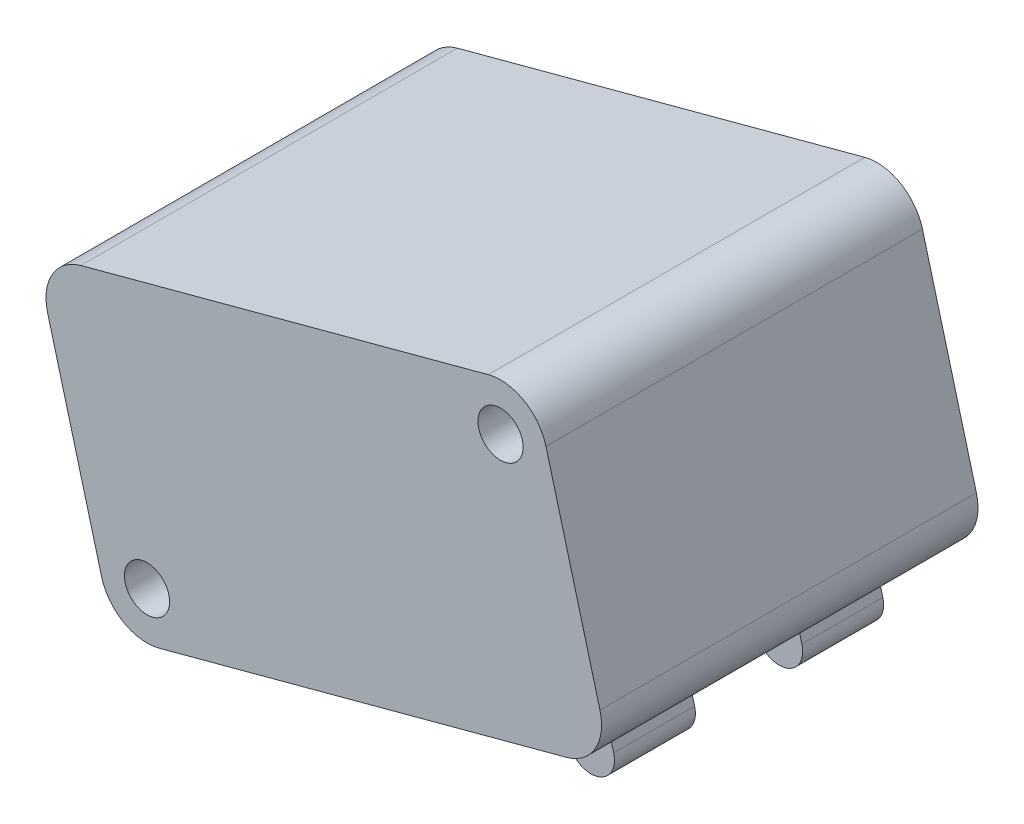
ISO-10303-21;
HEADER;
FILE_DESCRIPTION(('STEP AP214'),'2;1');
FILE_NAME('part.step','',(''),(''),'','','');
FILE_SCHEMA(('AUTOMOTIVE_DESIGN { 1 0 10303 214 1 1 1 1 }'));
ENDSEC;
DATA;
#1=APPLICATION_CONTEXT('core data for automotive mechanical design processes');
#2=APPLICATION_PROTOCOL_DEFINITION('international standard','automotive_design',2000,#1);
#3=PRODUCT_CONTEXT('',#1,'mechanical');
#4=PRODUCT('Part','Part','',(#3));
#5=PRODUCT_RELATED_PRODUCT_CATEGORY('part','',(#4));
#6=PRODUCT_DEFINITION_FORMATION('','',#4);
#7=PRODUCT_DEFINITION_CONTEXT('part definition',#1,'design');
#8=PRODUCT_DEFINITION('design','',#6,#7);
#9=PRODUCT_DEFINITION_SHAPE('','',#8);
#10=(LENGTH_UNIT() NAMED_UNIT(*) SI_UNIT(.MILLI.,.METRE.));
#11=(NAMED_UNIT(*) PLANE_ANGLE_UNIT() SI_UNIT($,.RADIAN.));
#12=(NAMED_UNIT(*) SI_UNIT($,.STERADIAN.) SOLID_ANGLE_UNIT());
#13=UNCERTAINTY_MEASURE_WITH_UNIT(LENGTH_MEASURE(1.E-05),#10,'distance_accuracy_value','');
#14=(GEOMETRIC_REPRESENTATION_CONTEXT(3) GLOBAL_UNCERTAINTY_ASSIGNED_CONTEXT((#13)) GLOBAL_UNIT_ASSIGNED_CONTEXT((#10,
#11,#12)) REPRESENTATION_CONTEXT('',''));
#15=CARTESIAN_POINT('',(0.,0.,0.));
#16=DIRECTION('',(0.,0.,1.));
#17=DIRECTION('',(1.,0.,0.));
#18=AXIS2_PLACEMENT_3D('',#15,#16,#17);
#19=CARTESIAN_POINT('',(-5.35712702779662,35.8393600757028,20.));
#20=DIRECTION('',(-0.258819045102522,0.965925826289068,0.));
#21=DIRECTION('',(-0.965925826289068,-0.258819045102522,0.));
#22=AXIS2_PLACEMENT_3D('',#19,#20,#21);
#23=PLANE('',#22);
#24=DIRECTION('',(0.,0.,-1.));
#25=VECTOR('',#24,1.);
#26=CARTESIAN_POINT('',(13.2004189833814,40.8118395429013,17.15));
#27=LINE('',#26,#25);
#28=CARTESIAN_POINT('',(13.2004189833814,40.8118395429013,17.15));
#29=VERTEX_POINT('',#28);
#30=CARTESIAN_POINT('',(13.2004189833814,40.8118395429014,12.85));
#31=VERTEX_POINT('',#30);
#32=EDGE_CURVE('E182',#29,#31,#27,.T.);
#33=ORIENTED_EDGE('',*,*,#32,.F.);
#34=DIRECTION('',(-0.965925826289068,-0.258819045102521,0.));
#35=VECTOR('',#34,1.);
#36=CARTESIAN_POINT('',(13.2004189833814,40.8118395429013,17.15));
#37=LINE('',#36,#35);
#38=CARTESIAN_POINT('',(15.615233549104,41.4588871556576,17.15));
#39=VERTEX_POINT('',#38);
#40=EDGE_CURVE('E191',#39,#29,#37,.T.);
#41=ORIENTED_EDGE('',*,*,#40,.F.);
#42=DIRECTION('',(0.,0.,1.));
#43=VECTOR('',#42,1.);
#44=CARTESIAN_POINT('',(15.6152335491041,41.4588871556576,17.15));
#45=LINE('',#44,#43);
#46=CARTESIAN_POINT('',(15.6152335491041,41.4588871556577,12.85));
#47=VERTEX_POINT('',#46);
#48=EDGE_CURVE('E188',#47,#39,#45,.T.);
#49=ORIENTED_EDGE('',*,*,#48,.F.);
#50=DIRECTION('',(0.965925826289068,0.258819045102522,0.));
#51=VECTOR('',#50,1.);
#52=CARTESIAN_POINT('',(13.2004189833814,40.8118395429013,12.85));
#53=LINE('',#52,#51);
#54=EDGE_CURVE('E185',#31,#47,#53,.T.);
#55=ORIENTED_EDGE('',*,*,#54,.F.);
#56=EDGE_LOOP('',(#33,#41,#49,#55));
#57=FACE_BOUND('',#56,.T.);
#58=DIRECTION('',(0.965925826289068,0.258819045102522,0.));
#59=VECTOR('',#58,1.);
#60=CARTESIAN_POINT('',(-5.35712702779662,35.8393600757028,0.));
#61=LINE('',#60,#59);
#62=CARTESIAN_POINT('',(-5.35712702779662,35.8393600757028,0.));
#63=VERTEX_POINT('',#62);
#64=CARTESIAN_POINT('',(16.2913816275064,41.6400604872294,0.));
#65=VERTEX_POINT('',#64);
#66=EDGE_CURVE('E213',#63,#65,#61,.T.);
#67=ORIENTED_EDGE('',*,*,#66,.T.);
#68=DIRECTION('',(0.,0.,-1.));
#69=VECTOR('',#68,1.);
#70=CARTESIAN_POINT('',(16.2913816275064,41.6400604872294,20.));
#71=LINE('',#70,#69);
#72=CARTESIAN_POINT('',(16.2913816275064,41.6400604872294,20.));
#73=VERTEX_POINT('',#72);
#74=EDGE_CURVE('E242',#73,#65,#71,.T.);
#75=ORIENTED_EDGE('',*,*,#74,.F.);
#76=DIRECTION('',(0.965925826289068,0.258819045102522,0.));
#77=VECTOR('',#76,1.);
#78=CARTESIAN_POINT('',(-5.35712702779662,35.8393600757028,20.));
#79=LINE('',#78,#77);
#80=CARTESIAN_POINT('',(-5.35712702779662,35.8393600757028,20.));
#81=VERTEX_POINT('',#80);
#82=EDGE_CURVE('E230',#81,#73,#79,.T.);
#83=ORIENTED_EDGE('',*,*,#82,.F.);
#84=DIRECTION('',(0.,0.,-1.));
#85=VECTOR('',#84,1.);
#86=CARTESIAN_POINT('',(-5.35712702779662,35.8393600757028,20.));
#87=LINE('',#86,#85);
#88=EDGE_CURVE('E245',#81,#63,#87,.T.);
#89=ORIENTED_EDGE('',*,*,#88,.T.);
#90=EDGE_LOOP('',(#67,#75,#83,#89));
#91=FACE_BOUND('',#90,.T.);
#92=DIRECTION('',(0.,0.,-1.));
#93=VECTOR('',#92,1.);
#94=CARTESIAN_POINT('',(13.2004189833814,40.8118395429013,2.85));
#95=LINE('',#94,#93);
#96=CARTESIAN_POINT('',(13.2004189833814,40.8118395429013,7.15));
#97=VERTEX_POINT('',#96);
#98=CARTESIAN_POINT('',(13.2004189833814,40.8118395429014,2.85));
#99=VERTEX_POINT('',#98);
#100=EDGE_CURVE('E153',#97,#99,#95,.T.);
#101=ORIENTED_EDGE('',*,*,#100,.F.);
#102=DIRECTION('',(-0.965925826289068,-0.258819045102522,0.));
#103=VECTOR('',#102,1.);
#104=CARTESIAN_POINT('',(13.2004189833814,40.8118395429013,7.15));
#105=LINE('',#104,#103);
#106=CARTESIAN_POINT('',(15.615233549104,41.4588871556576,7.15));
#107=VERTEX_POINT('',#106);
#108=EDGE_CURVE('E159',#107,#97,#105,.T.);
#109=ORIENTED_EDGE('',*,*,#108,.F.);
#110=DIRECTION('',(0.,0.,1.));
#111=VECTOR('',#110,1.);
#112=CARTESIAN_POINT('',(15.6152335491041,41.4588871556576,2.85));
#113=LINE('',#112,#111);
#114=CARTESIAN_POINT('',(15.6152335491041,41.4588871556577,2.85));
#115=VERTEX_POINT('',#114);
#116=EDGE_CURVE('E172',#115,#107,#113,.T.);
#117=ORIENTED_EDGE('',*,*,#116,.F.);
#118=DIRECTION('',(0.965925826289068,0.258819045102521,0.));
#119=VECTOR('',#118,1.);
#120=CARTESIAN_POINT('',(13.2004189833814,40.8118395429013,2.85));
#121=LINE('',#120,#119);
#122=EDGE_CURVE('E167',#99,#115,#121,.T.);
#123=ORIENTED_EDGE('',*,*,#122,.F.);
#124=EDGE_LOOP('',(#101,#109,#117,#123));
#125=FACE_BOUND('',#124,.T.);
#126=ADVANCED_FACE('F29',(#57,#91,#125),#23,.F.);
#127=CARTESIAN_POINT('',(12.77746533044,54.7541746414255,20.));
#128=DIRECTION('',(0.,0.,-1.));
#129=DIRECTION('',(-1.,0.,0.));
#130=AXIS2_PLACEMENT_3D('',#127,#128,#129);
#131=CYLINDRICAL_SURFACE('',#130,2.5);
#132=CARTESIAN_POINT('',(12.77746533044,54.7541746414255,0.));
#133=DIRECTION('',(0.,0.,1.));
#134=DIRECTION('',(1.,0.,0.));
#135=AXIS2_PLACEMENT_3D('',#132,#133,#134);
#136=CIRCLE('',#135,2.5);
#137=CARTESIAN_POINT('',(15.1922798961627,55.4012222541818,0.));
#138=VERTEX_POINT('',#137);
#139=CARTESIAN_POINT('',(12.1304177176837,57.1689892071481,0.));
#140=VERTEX_POINT('',#139);
#141=EDGE_CURVE('E202',#138,#140,#136,.T.);
#142=ORIENTED_EDGE('',*,*,#141,.T.);
#143=DIRECTION('',(0.,0.,-1.));
#144=VECTOR('',#143,1.);
#145=CARTESIAN_POINT('',(12.1304177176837,57.1689892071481,20.));
#146=LINE('',#145,#144);
#147=CARTESIAN_POINT('',(12.1304177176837,57.1689892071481,20.));
#148=VERTEX_POINT('',#147);
#149=EDGE_CURVE('E257',#148,#140,#146,.T.);
#150=ORIENTED_EDGE('',*,*,#149,.F.);
#151=CARTESIAN_POINT('',(12.77746533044,54.7541746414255,20.));
#152=DIRECTION('',(0.,0.,1.));
#153=DIRECTION('',(1.,0.,0.));
#154=AXIS2_PLACEMENT_3D('',#151,#152,#153);
#155=CIRCLE('',#154,2.5);
#156=CARTESIAN_POINT('',(15.1922798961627,55.4012222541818,20.));
#157=VERTEX_POINT('',#156);
#158=EDGE_CURVE('E219',#157,#148,#155,.T.);
#159=ORIENTED_EDGE('',*,*,#158,.F.);
#160=DIRECTION('',(0.,0.,-1.));
#161=VECTOR('',#160,1.);
#162=CARTESIAN_POINT('',(15.1922798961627,55.4012222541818,20.));
#163=LINE('',#162,#161);
#164=EDGE_CURVE('E236',#157,#138,#163,.T.);
#165=ORIENTED_EDGE('',*,*,#164,.T.);
#166=EDGE_LOOP('',(#142,#150,#159,#165));
#167=FACE_BOUND('',#166,.T.);
#168=ADVANCED_FACE('F31',(#167),#131,.T.);
#169=CARTESIAN_POINT('',(12.1304177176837,57.1689892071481,20.));
#170=DIRECTION('',(0.258819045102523,-0.965925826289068,0.));
#171=DIRECTION('',(0.965925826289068,0.258819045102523,0.));
#172=AXIS2_PLACEMENT_3D('',#169,#170,#171);
#173=PLANE('',#172);
#174=DIRECTION('',(-0.965925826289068,-0.258819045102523,0.));
#175=VECTOR('',#174,1.);
#176=CARTESIAN_POINT('',(12.1304177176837,57.1689892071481,0.));
#177=LINE('',#176,#175);
#178=CARTESIAN_POINT('',(-9.51809093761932,51.3682887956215,0.));
#179=VERTEX_POINT('',#178);
#180=EDGE_CURVE('E205',#140,#179,#177,.T.);
#181=ORIENTED_EDGE('',*,*,#180,.T.);
#182=DIRECTION('',(0.,0.,-1.));
#183=VECTOR('',#182,1.);
#184=CARTESIAN_POINT('',(-9.51809093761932,51.3682887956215,20.));
#185=LINE('',#184,#183);
#186=CARTESIAN_POINT('',(-9.51809093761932,51.3682887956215,20.));
#187=VERTEX_POINT('',#186);
#188=EDGE_CURVE('E254',#187,#179,#185,.T.);
#189=ORIENTED_EDGE('',*,*,#188,.F.);
#190=DIRECTION('',(-0.965925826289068,-0.258819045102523,0.));
#191=VECTOR('',#190,1.);
#192=CARTESIAN_POINT('',(12.1304177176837,57.1689892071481,20.));
#193=LINE('',#192,#191);
#194=EDGE_CURVE('E222',#148,#187,#193,.T.);
#195=ORIENTED_EDGE('',*,*,#194,.F.);
#196=ORIENTED_EDGE('',*,*,#149,.T.);
#197=EDGE_LOOP('',(#181,#189,#195,#196));
#198=FACE_BOUND('',#197,.T.);
#199=ADVANCED_FACE('F350',(#198),#173,.F.);
#200=CARTESIAN_POINT('',(-8.87104332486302,48.9534742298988,20.));
#201=DIRECTION('',(0.,0.,-1.));
#202=DIRECTION('',(-1.,0.,0.));
#203=AXIS2_PLACEMENT_3D('',#200,#201,#202);
#204=CYLINDRICAL_SURFACE('',#203,2.49999999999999);
#205=CARTESIAN_POINT('',(-8.87104332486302,48.9534742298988,0.));
#206=DIRECTION('',(0.,0.,1.));
#207=DIRECTION('',(-1.,0.,0.));
#208=AXIS2_PLACEMENT_3D('',#205,#206,#207);
#209=CIRCLE('',#208,2.49999999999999);
#210=CARTESIAN_POINT('',(-11.2858578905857,48.3064266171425,0.));
#211=VERTEX_POINT('',#210);
#212=EDGE_CURVE('E207',#179,#211,#209,.T.);
#213=ORIENTED_EDGE('',*,*,#212,.T.);
#214=DIRECTION('',(0.,0.,-1.));
#215=VECTOR('',#214,1.);
#216=CARTESIAN_POINT('',(-11.2858578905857,48.3064266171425,20.));
#217=LINE('',#216,#215);
#218=CARTESIAN_POINT('',(-11.2858578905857,48.3064266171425,20.));
#219=VERTEX_POINT('',#218);
#220=EDGE_CURVE('E251',#219,#211,#217,.T.);
#221=ORIENTED_EDGE('',*,*,#220,.F.);
#222=CARTESIAN_POINT('',(-8.87104332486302,48.9534742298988,20.));
#223=DIRECTION('',(0.,0.,1.));
#224=DIRECTION('',(-1.,0.,0.));
#225=AXIS2_PLACEMENT_3D('',#222,#223,#224);
#226=CIRCLE('',#225,2.49999999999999);
#227=EDGE_CURVE('E224',#187,#219,#226,.T.);
#228=ORIENTED_EDGE('',*,*,#227,.F.);
#229=ORIENTED_EDGE('',*,*,#188,.T.);
#230=EDGE_LOOP('',(#213,#221,#228,#229));
#231=FACE_BOUND('',#230,.T.);
#232=ADVANCED_FACE('F346',(#231),#204,.T.);
#233=CARTESIAN_POINT('',(-11.2858578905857,48.3064266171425,20.));
#234=DIRECTION('',(0.965925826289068,0.258819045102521,0.));
#235=DIRECTION('',(-0.258819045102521,0.965925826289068,0.));
#236=AXIS2_PLACEMENT_3D('',#233,#234,#235);
#237=PLANE('',#236);
#238=DIRECTION('',(0.258819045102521,-0.965925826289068,0.));
#239=VECTOR('',#238,1.);
#240=CARTESIAN_POINT('',(-11.2858578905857,48.3064266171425,0.));
#241=LINE('',#240,#239);
#242=CARTESIAN_POINT('',(-8.41898920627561,37.6071270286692,0.));
#243=VERTEX_POINT('',#242);
#244=EDGE_CURVE('E209',#211,#243,#241,.T.);
#245=ORIENTED_EDGE('',*,*,#244,.T.);
#246=DIRECTION('',(0.,0.,-1.));
#247=VECTOR('',#246,1.);
#248=CARTESIAN_POINT('',(-8.41898920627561,37.6071270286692,20.));
#249=LINE('',#248,#247);
#250=CARTESIAN_POINT('',(-8.41898920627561,37.6071270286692,20.));
#251=VERTEX_POINT('',#250);
#252=EDGE_CURVE('E248',#251,#243,#249,.T.);
#253=ORIENTED_EDGE('',*,*,#252,.F.);
#254=DIRECTION('',(0.258819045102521,-0.965925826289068,0.));
#255=VECTOR('',#254,1.);
#256=CARTESIAN_POINT('',(-11.2858578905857,48.3064266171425,20.));
#257=LINE('',#256,#255);
#258=EDGE_CURVE('E226',#219,#251,#257,.T.);
#259=ORIENTED_EDGE('',*,*,#258,.F.);
#260=ORIENTED_EDGE('',*,*,#220,.T.);
#261=EDGE_LOOP('',(#245,#253,#259,#260));
#262=FACE_BOUND('',#261,.T.);
#263=ADVANCED_FACE('F343',(#262),#237,.F.);
#264=CARTESIAN_POINT('',(-6.00417464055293,38.2541746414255,20.));
#265=DIRECTION('',(0.,0.,-1.));
#266=DIRECTION('',(-1.,0.,0.));
#267=AXIS2_PLACEMENT_3D('',#264,#265,#266);
#268=CYLINDRICAL_SURFACE('',#267,2.50000000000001);
#269=CARTESIAN_POINT('',(-6.00417464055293,38.2541746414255,0.));
#270=DIRECTION('',(0.,0.,1.));
#271=DIRECTION('',(1.,0.,0.));
#272=AXIS2_PLACEMENT_3D('',#269,#270,#271);
#273=CIRCLE('',#272,2.50000000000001);
#274=EDGE_CURVE('E211',#243,#63,#273,.T.);
#275=ORIENTED_EDGE('',*,*,#274,.T.);
#276=ORIENTED_EDGE('',*,*,#88,.F.);
#277=CARTESIAN_POINT('',(-6.00417464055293,38.2541746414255,20.));
#278=DIRECTION('',(0.,0.,1.));
#279=DIRECTION('',(1.,0.,0.));
#280=AXIS2_PLACEMENT_3D('',#277,#278,#279);
#281=CIRCLE('',#280,2.50000000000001);
#282=EDGE_CURVE('E228',#251,#81,#281,.T.);
#283=ORIENTED_EDGE('',*,*,#282,.F.);
#284=ORIENTED_EDGE('',*,*,#252,.T.);
#285=EDGE_LOOP('',(#275,#276,#283,#284));
#286=FACE_BOUND('',#285,.T.);
#287=ADVANCED_FACE('F339',(#286),#268,.T.);
#288=CARTESIAN_POINT('',(15.6443340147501,44.0548750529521,20.));
#289=DIRECTION('',(0.,0.,-1.));
#290=DIRECTION('',(-1.,0.,0.));
#291=AXIS2_PLACEMENT_3D('',#288,#289,#290);
#292=CYLINDRICAL_SURFACE('',#291,2.49999999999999);
#293=CARTESIAN_POINT('',(15.6443340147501,44.0548750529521,0.));
#294=DIRECTION('',(0.,0.,1.));
#295=DIRECTION('',(-1.,0.,0.));
#296=AXIS2_PLACEMENT_3D('',#293,#294,#295);
#297=CIRCLE('',#296,2.49999999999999);
#298=CARTESIAN_POINT('',(18.0591485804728,44.7019226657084,0.));
#299=VERTEX_POINT('',#298);
#300=EDGE_CURVE('E215',#65,#299,#297,.T.);
#301=ORIENTED_EDGE('',*,*,#300,.T.);
#302=DIRECTION('',(0.,0.,-1.));
#303=VECTOR('',#302,1.);
#304=CARTESIAN_POINT('',(18.0591485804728,44.7019226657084,20.));
#305=LINE('',#304,#303);
#306=CARTESIAN_POINT('',(18.0591485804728,44.7019226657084,20.));
#307=VERTEX_POINT('',#306);
#308=EDGE_CURVE('E239',#307,#299,#305,.T.);
#309=ORIENTED_EDGE('',*,*,#308,.F.);
#310=CARTESIAN_POINT('',(15.6443340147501,44.0548750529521,20.));
#311=DIRECTION('',(0.,0.,1.));
#312=DIRECTION('',(-1.,0.,0.));
#313=AXIS2_PLACEMENT_3D('',#310,#311,#312);
#314=CIRCLE('',#313,2.49999999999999);
#315=EDGE_CURVE('E232',#73,#307,#314,.T.);
#316=ORIENTED_EDGE('',*,*,#315,.F.);
#317=ORIENTED_EDGE('',*,*,#74,.T.);
#318=EDGE_LOOP('',(#301,#309,#316,#317));
#319=FACE_BOUND('',#318,.T.);
#320=ADVANCED_FACE('F329',(#319),#292,.T.);
#321=CARTESIAN_POINT('',(15.1922798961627,55.4012222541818,20.));
#322=DIRECTION('',(-0.965925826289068,-0.258819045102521,0.));
#323=DIRECTION('',(0.258819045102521,-0.965925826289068,0.));
#324=AXIS2_PLACEMENT_3D('',#321,#322,#323);
#325=PLANE('',#324);
#326=DIRECTION('',(-0.258819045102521,0.965925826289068,0.));
#327=VECTOR('',#326,1.);
#328=CARTESIAN_POINT('',(15.1922798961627,55.4012222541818,0.));
#329=LINE('',#328,#327);
#330=EDGE_CURVE('E217',#299,#138,#329,.T.);
#331=ORIENTED_EDGE('',*,*,#330,.T.);
#332=ORIENTED_EDGE('',*,*,#164,.F.);
#333=DIRECTION('',(-0.258819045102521,0.965925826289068,0.));
#334=VECTOR('',#333,1.);
#335=CARTESIAN_POINT('',(15.1922798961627,55.4012222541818,20.));
#336=LINE('',#335,#334);
#337=EDGE_CURVE('E234',#307,#157,#336,.T.);
#338=ORIENTED_EDGE('',*,*,#337,.F.);
#339=ORIENTED_EDGE('',*,*,#308,.T.);
#340=EDGE_LOOP('',(#331,#332,#338,#339));
#341=FACE_BOUND('',#340,.T.);
#342=ADVANCED_FACE('F325',(#341),#325,.F.);
#343=CARTESIAN_POINT('',(12.77746533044,54.7541746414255,20.));
#344=DIRECTION('',(0.,0.,1.));
#345=DIRECTION('',(1.,0.,0.));
#346=AXIS2_PLACEMENT_3D('',#343,#344,#345);
#347=PLANE('',#346);
#348=CARTESIAN_POINT('',(12.77746533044,54.7541746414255,20.));
#349=DIRECTION('',(0.,0.,1.));
#350=DIRECTION('',(1.,0.,0.));
#351=AXIS2_PLACEMENT_3D('',#348,#349,#350);
#352=CIRCLE('',#351,1.20000000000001);
#353=CARTESIAN_POINT('',(13.97746533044,54.7541746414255,20.));
#354=VERTEX_POINT('',#353);
#355=EDGE_CURVE('E298',#354,#354,#352,.T.);
#356=ORIENTED_EDGE('',*,*,#355,.F.);
#357=EDGE_LOOP('',(#356));
#358=FACE_BOUND('',#357,.T.);
#359=CARTESIAN_POINT('',(-6.00417464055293,38.2541746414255,20.));
#360=DIRECTION('',(0.,0.,1.));
#361=DIRECTION('',(1.,0.,0.));
#362=AXIS2_PLACEMENT_3D('',#359,#360,#361);
#363=CIRCLE('',#362,1.2);
#364=CARTESIAN_POINT('',(-4.80417464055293,38.2541746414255,20.));
#365=VERTEX_POINT('',#364);
#366=EDGE_CURVE('E292',#365,#365,#363,.T.);
#367=ORIENTED_EDGE('',*,*,#366,.F.);
#368=EDGE_LOOP('',(#367));
#369=FACE_BOUND('',#368,.T.);
#370=ORIENTED_EDGE('',*,*,#158,.T.);
#371=ORIENTED_EDGE('',*,*,#194,.T.);
#372=ORIENTED_EDGE('',*,*,#227,.T.);
#373=ORIENTED_EDGE('',*,*,#258,.T.);
#374=ORIENTED_EDGE('',*,*,#282,.T.);
#375=ORIENTED_EDGE('',*,*,#82,.T.);
#376=ORIENTED_EDGE('',*,*,#315,.T.);
#377=ORIENTED_EDGE('',*,*,#337,.T.);
#378=EDGE_LOOP('',(#370,#371,#372,#373,#374,#375,#376,#377));
#379=FACE_BOUND('',#378,.T.);
#380=ADVANCED_FACE('F311',(#358,#369,#379),#347,.T.);
#381=CARTESIAN_POINT('',(12.77746533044,54.7541746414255,0.));
#382=DIRECTION('',(0.,0.,1.));
#383=DIRECTION('',(1.,0.,0.));
#384=AXIS2_PLACEMENT_3D('',#381,#382,#383);
#385=PLANE('',#384);
#386=CARTESIAN_POINT('',(12.77746533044,54.7541746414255,0.));
#387=DIRECTION('',(0.,0.,-1.));
#388=DIRECTION('',(-1.,0.,0.));
#389=AXIS2_PLACEMENT_3D('',#386,#387,#388);
#390=CIRCLE('',#389,1.20000000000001);
#391=CARTESIAN_POINT('',(11.57746533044,54.7541746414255,0.));
#392=VERTEX_POINT('',#391);
#393=EDGE_CURVE('E301',#392,#392,#390,.T.);
#394=ORIENTED_EDGE('',*,*,#393,.F.);
#395=EDGE_LOOP('',(#394));
#396=FACE_BOUND('',#395,.T.);
#397=CARTESIAN_POINT('',(-6.00417464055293,38.2541746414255,0.));
#398=DIRECTION('',(0.,0.,-1.));
#399=DIRECTION('',(-1.,0.,0.));
#400=AXIS2_PLACEMENT_3D('',#397,#398,#399);
#401=CIRCLE('',#400,1.2);
#402=CARTESIAN_POINT('',(-7.20417464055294,38.2541746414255,0.));
#403=VERTEX_POINT('',#402);
#404=EDGE_CURVE('E295',#403,#403,#401,.T.);
#405=ORIENTED_EDGE('',*,*,#404,.F.);
#406=EDGE_LOOP('',(#405));
#407=FACE_BOUND('',#406,.T.);
#408=ORIENTED_EDGE('',*,*,#141,.F.);
#409=ORIENTED_EDGE('',*,*,#330,.F.);
#410=ORIENTED_EDGE('',*,*,#300,.F.);
#411=ORIENTED_EDGE('',*,*,#66,.F.);
#412=ORIENTED_EDGE('',*,*,#274,.F.);
#413=ORIENTED_EDGE('',*,*,#244,.F.);
#414=ORIENTED_EDGE('',*,*,#212,.F.);
#415=ORIENTED_EDGE('',*,*,#180,.F.);
#416=EDGE_LOOP('',(#408,#409,#410,#411,#412,#413,#414,#415));
#417=FACE_BOUND('',#416,.T.);
#418=ADVANCED_FACE('F307',(#396,#407,#417),#385,.F.);
#419=CARTESIAN_POINT('',(13.8474665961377,38.3970249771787,17.15));
#420=DIRECTION('',(0.965925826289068,0.258819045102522,0.));
#421=DIRECTION('',(-0.258819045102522,0.965925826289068,0.));
#422=AXIS2_PLACEMENT_3D('',#419,#420,#421);
#423=PLANE('',#422);
#424=DIRECTION('',(-0.258819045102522,0.965925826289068,0.));
#425=VECTOR('',#424,1.);
#426=CARTESIAN_POINT('',(13.8474665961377,38.3970249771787,12.85));
#427=LINE('',#426,#425);
#428=CARTESIAN_POINT('',(13.5239427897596,39.60443226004,12.85));
#429=VERTEX_POINT('',#428);
#430=EDGE_CURVE('E200',#429,#31,#427,.T.);
#431=ORIENTED_EDGE('',*,*,#430,.F.);
#432=DIRECTION('',(0.,0.,-1.));
#433=VECTOR('',#432,1.);
#434=CARTESIAN_POINT('',(13.5239427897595,39.60443226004,17.15));
#435=LINE('',#434,#433);
#436=CARTESIAN_POINT('',(13.5239427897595,39.60443226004,17.15));
#437=VERTEX_POINT('',#436);
#438=EDGE_CURVE('E271',#429,#437,#435,.F.);
#439=ORIENTED_EDGE('',*,*,#438,.T.);
#440=DIRECTION('',(-0.258819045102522,0.965925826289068,0.));
#441=VECTOR('',#440,1.);
#442=CARTESIAN_POINT('',(13.8474665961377,38.3970249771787,17.15));
#443=LINE('',#442,#441);
#444=EDGE_CURVE('E194',#437,#29,#443,.T.);
#445=ORIENTED_EDGE('',*,*,#444,.T.);
#446=ORIENTED_EDGE('',*,*,#32,.T.);
#447=EDGE_LOOP('',(#431,#439,#445,#446));
#448=FACE_BOUND('',#447,.T.);
#449=ADVANCED_FACE('F310',(#448),#423,.F.);
#450=CARTESIAN_POINT('',(13.8474665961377,38.3970249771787,12.85));
#451=DIRECTION('',(0.,0.,1.));
#452=DIRECTION('',(1.,0.,0.));
#453=AXIS2_PLACEMENT_3D('',#450,#451,#452);
#454=PLANE('',#453);
#455=DIRECTION('',(-0.258819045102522,0.965925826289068,0.));
#456=VECTOR('',#455,1.);
#457=CARTESIAN_POINT('',(16.2622811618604,39.044072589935,12.85));
#458=LINE('',#457,#456);
#459=CARTESIAN_POINT('',(15.9387573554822,40.2514798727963,12.85));
#460=VERTEX_POINT('',#459);
#461=EDGE_CURVE('E198',#460,#47,#458,.T.);
#462=ORIENTED_EDGE('',*,*,#461,.F.);
#463=CARTESIAN_POINT('',(14.7313500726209,39.9279560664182,12.85));
#464=DIRECTION('',(0.,0.,1.));
#465=DIRECTION('',(1.,0.,0.));
#466=AXIS2_PLACEMENT_3D('',#463,#464,#465);
#467=CIRCLE('',#466,1.25);
#468=CARTESIAN_POINT('',(15.054873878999,38.7205487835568,12.85));
#469=VERTEX_POINT('',#468);
#470=EDGE_CURVE('E269',#460,#469,#467,.F.);
#471=ORIENTED_EDGE('',*,*,#470,.T.);
#472=CARTESIAN_POINT('',(14.7313500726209,39.9279560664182,12.85));
#473=DIRECTION('',(0.,0.,1.));
#474=DIRECTION('',(1.,0.,0.));
#475=AXIS2_PLACEMENT_3D('',#472,#473,#474);
#476=CIRCLE('',#475,1.25);
#477=EDGE_CURVE('E267',#469,#429,#476,.F.);
#478=ORIENTED_EDGE('',*,*,#477,.T.);
#479=ORIENTED_EDGE('',*,*,#430,.T.);
#480=ORIENTED_EDGE('',*,*,#54,.T.);
#481=EDGE_LOOP('',(#462,#471,#478,#479,#480));
#482=FACE_BOUND('',#481,.T.);
#483=ADVANCED_FACE('F421',(#482),#454,.F.);
#484=CARTESIAN_POINT('',(16.2622811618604,39.044072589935,17.15));
#485=DIRECTION('',(-0.965925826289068,-0.258819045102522,0.));
#486=DIRECTION('',(0.258819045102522,-0.965925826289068,0.));
#487=AXIS2_PLACEMENT_3D('',#484,#485,#486);
#488=PLANE('',#487);
#489=DIRECTION('',(-0.258819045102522,0.965925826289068,0.));
#490=VECTOR('',#489,1.);
#491=CARTESIAN_POINT('',(16.2622811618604,39.044072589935,17.15));
#492=LINE('',#491,#490);
#493=CARTESIAN_POINT('',(15.9387573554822,40.2514798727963,17.15));
#494=VERTEX_POINT('',#493);
#495=EDGE_CURVE('E196',#494,#39,#492,.T.);
#496=ORIENTED_EDGE('',*,*,#495,.F.);
#497=DIRECTION('',(0.,0.,1.));
#498=VECTOR('',#497,1.);
#499=CARTESIAN_POINT('',(15.9387573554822,40.2514798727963,12.85));
#500=LINE('',#499,#498);
#501=EDGE_CURVE('E264',#494,#460,#500,.F.);
#502=ORIENTED_EDGE('',*,*,#501,.T.);
#503=ORIENTED_EDGE('',*,*,#461,.T.);
#504=ORIENTED_EDGE('',*,*,#48,.T.);
#505=EDGE_LOOP('',(#496,#502,#503,#504));
#506=FACE_BOUND('',#505,.T.);
#507=ADVANCED_FACE('F431',(#506),#488,.F.);
#508=CARTESIAN_POINT('',(13.8474665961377,38.3970249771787,17.15));
#509=DIRECTION('',(0.,0.,-1.));
#510=DIRECTION('',(-1.,0.,0.));
#511=AXIS2_PLACEMENT_3D('',#508,#509,#510);
#512=PLANE('',#511);
#513=CARTESIAN_POINT('',(14.7313500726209,39.9279560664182,17.15));
#514=DIRECTION('',(0.,0.,-1.));
#515=DIRECTION('',(-1.,0.,0.));
#516=AXIS2_PLACEMENT_3D('',#513,#514,#515);
#517=CIRCLE('',#516,1.25);
#518=CARTESIAN_POINT('',(15.054873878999,38.7205487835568,17.15));
#519=VERTEX_POINT('',#518);
#520=EDGE_CURVE('E260',#437,#519,#517,.F.);
#521=ORIENTED_EDGE('',*,*,#520,.T.);
#522=CARTESIAN_POINT('',(14.7313500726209,39.9279560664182,17.15));
#523=DIRECTION('',(0.,0.,-1.));
#524=DIRECTION('',(-1.,0.,0.));
#525=AXIS2_PLACEMENT_3D('',#522,#523,#524);
#526=CIRCLE('',#525,1.25);
#527=EDGE_CURVE('E262',#519,#494,#526,.F.);
#528=ORIENTED_EDGE('',*,*,#527,.T.);
#529=ORIENTED_EDGE('',*,*,#495,.T.);
#530=ORIENTED_EDGE('',*,*,#40,.T.);
#531=ORIENTED_EDGE('',*,*,#444,.F.);
#532=EDGE_LOOP('',(#521,#528,#529,#530,#531));
#533=FACE_BOUND('',#532,.T.);
#534=ADVANCED_FACE('F441',(#533),#512,.F.);
#535=CARTESIAN_POINT('',(13.8474665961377,38.3970249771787,2.85));
#536=DIRECTION('',(0.965925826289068,0.258819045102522,0.));
#537=DIRECTION('',(-0.258819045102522,0.965925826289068,0.));
#538=AXIS2_PLACEMENT_3D('',#535,#536,#537);
#539=PLANE('',#538);
#540=DIRECTION('',(-0.258819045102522,0.965925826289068,0.));
#541=VECTOR('',#540,1.);
#542=CARTESIAN_POINT('',(13.8474665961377,38.3970249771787,2.85));
#543=LINE('',#542,#541);
#544=CARTESIAN_POINT('',(13.5239427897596,39.60443226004,2.85));
#545=VERTEX_POINT('',#544);
#546=EDGE_CURVE('E180',#545,#99,#543,.T.);
#547=ORIENTED_EDGE('',*,*,#546,.F.);
#548=DIRECTION('',(0.,0.,-1.));
#549=VECTOR('',#548,1.);
#550=CARTESIAN_POINT('',(13.5239427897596,39.60443226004,2.85));
#551=LINE('',#550,#549);
#552=CARTESIAN_POINT('',(13.5239427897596,39.60443226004,7.15));
#553=VERTEX_POINT('',#552);
#554=EDGE_CURVE('E11',#545,#553,#551,.F.);
#555=ORIENTED_EDGE('',*,*,#554,.T.);
#556=DIRECTION('',(-0.258819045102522,0.965925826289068,0.));
#557=VECTOR('',#556,1.);
#558=CARTESIAN_POINT('',(13.8474665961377,38.3970249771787,7.15));
#559=LINE('',#558,#557);
#560=EDGE_CURVE('E150',#553,#97,#559,.T.);
#561=ORIENTED_EDGE('',*,*,#560,.T.);
#562=ORIENTED_EDGE('',*,*,#100,.T.);
#563=EDGE_LOOP('',(#547,#555,#561,#562));
#564=FACE_BOUND('',#563,.T.);
#565=ADVANCED_FACE('F152',(#564),#539,.F.);
#566=CARTESIAN_POINT('',(13.8474665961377,38.3970249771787,2.85));
#567=DIRECTION('',(0.,0.,1.));
#568=DIRECTION('',(1.,0.,0.));
#569=AXIS2_PLACEMENT_3D('',#566,#567,#568);
#570=PLANE('',#569);
#571=DIRECTION('',(-0.258819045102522,0.965925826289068,0.));
#572=VECTOR('',#571,1.);
#573=CARTESIAN_POINT('',(16.2622811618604,39.044072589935,2.85));
#574=LINE('',#573,#572);
#575=CARTESIAN_POINT('',(15.9387573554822,40.2514798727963,2.85));
#576=VERTEX_POINT('',#575);
#577=EDGE_CURVE('E178',#576,#115,#574,.T.);
#578=ORIENTED_EDGE('',*,*,#577,.F.);
#579=CARTESIAN_POINT('',(14.7313500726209,39.9279560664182,2.85));
#580=DIRECTION('',(0.,0.,1.));
#581=DIRECTION('',(1.,0.,0.));
#582=AXIS2_PLACEMENT_3D('',#579,#580,#581);
#583=CIRCLE('',#582,1.25);
#584=CARTESIAN_POINT('',(15.054873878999,38.7205487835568,2.85));
#585=VERTEX_POINT('',#584);
#586=EDGE_CURVE('E37',#576,#585,#583,.F.);
#587=ORIENTED_EDGE('',*,*,#586,.T.);
#588=CARTESIAN_POINT('',(14.7313500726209,39.9279560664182,2.85));
#589=DIRECTION('',(0.,0.,1.));
#590=DIRECTION('',(1.,0.,0.));
#591=AXIS2_PLACEMENT_3D('',#588,#589,#590);
#592=CIRCLE('',#591,1.25);
#593=EDGE_CURVE('E44',#585,#545,#592,.F.);
#594=ORIENTED_EDGE('',*,*,#593,.T.);
#595=ORIENTED_EDGE('',*,*,#546,.T.);
#596=ORIENTED_EDGE('',*,*,#122,.T.);
#597=EDGE_LOOP('',(#578,#587,#594,#595,#596));
#598=FACE_BOUND('',#597,.T.);
#599=ADVANCED_FACE('F285',(#598),#570,.F.);
#600=CARTESIAN_POINT('',(16.2622811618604,39.044072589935,2.85));
#601=DIRECTION('',(-0.965925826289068,-0.258819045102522,0.));
#602=DIRECTION('',(0.258819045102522,-0.965925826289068,0.));
#603=AXIS2_PLACEMENT_3D('',#600,#601,#602);
#604=PLANE('',#603);
#605=DIRECTION('',(-0.258819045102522,0.965925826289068,0.));
#606=VECTOR('',#605,1.);
#607=CARTESIAN_POINT('',(16.2622811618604,39.044072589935,7.15));
#608=LINE('',#607,#606);
#609=CARTESIAN_POINT('',(15.9387573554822,40.2514798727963,7.15));
#610=VERTEX_POINT('',#609);
#611=EDGE_CURVE('E158',#610,#107,#608,.T.);
#612=ORIENTED_EDGE('',*,*,#611,.F.);
#613=DIRECTION('',(0.,0.,1.));
#614=VECTOR('',#613,1.);
#615=CARTESIAN_POINT('',(15.9387573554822,40.2514798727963,2.85));
#616=LINE('',#615,#614);
#617=EDGE_CURVE('E277',#610,#576,#616,.F.);
#618=ORIENTED_EDGE('',*,*,#617,.T.);
#619=ORIENTED_EDGE('',*,*,#577,.T.);
#620=ORIENTED_EDGE('',*,*,#116,.T.);
#621=EDGE_LOOP('',(#612,#618,#619,#620));
#622=FACE_BOUND('',#621,.T.);
#623=ADVANCED_FACE('F282',(#622),#604,.F.);
#624=CARTESIAN_POINT('',(13.8474665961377,38.3970249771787,7.15));
#625=DIRECTION('',(0.,0.,-1.));
#626=DIRECTION('',(-1.,0.,0.));
#627=AXIS2_PLACEMENT_3D('',#624,#625,#626);
#628=PLANE('',#627);
#629=CARTESIAN_POINT('',(14.7313500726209,39.9279560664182,7.15));
#630=DIRECTION('',(0.,0.,-1.));
#631=DIRECTION('',(-1.,0.,0.));
#632=AXIS2_PLACEMENT_3D('',#629,#630,#631);
#633=CIRCLE('',#632,1.25);
#634=CARTESIAN_POINT('',(15.054873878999,38.7205487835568,7.15));
#635=VERTEX_POINT('',#634);
#636=EDGE_CURVE('E273',#553,#635,#633,.F.);
#637=ORIENTED_EDGE('',*,*,#636,.T.);
#638=CARTESIAN_POINT('',(14.7313500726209,39.9279560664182,7.15));
#639=DIRECTION('',(0.,0.,-1.));
#640=DIRECTION('',(-1.,0.,0.));
#641=AXIS2_PLACEMENT_3D('',#638,#639,#640);
#642=CIRCLE('',#641,1.25);
#643=EDGE_CURVE('E275',#635,#610,#642,.F.);
#644=ORIENTED_EDGE('',*,*,#643,.T.);
#645=ORIENTED_EDGE('',*,*,#611,.T.);
#646=ORIENTED_EDGE('',*,*,#108,.T.);
#647=ORIENTED_EDGE('',*,*,#560,.F.);
#648=EDGE_LOOP('',(#637,#644,#645,#646,#647));
#649=FACE_BOUND('',#648,.T.);
#650=ADVANCED_FACE('F170',(#649),#628,.F.);
#651=CARTESIAN_POINT('',(14.7313500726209,39.9279560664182,12.85));
#652=DIRECTION('',(0.,0.,1.));
#653=DIRECTION('',(1.,0.,0.));
#654=AXIS2_PLACEMENT_3D('',#651,#652,#653);
#655=CYLINDRICAL_SURFACE('',#654,1.25);
#656=ORIENTED_EDGE('',*,*,#438,.F.);
#657=ORIENTED_EDGE('',*,*,#477,.F.);
#658=DIRECTION('',(0.,0.,-1.));
#659=VECTOR('',#658,1.);
#660=CARTESIAN_POINT('',(15.054873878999,38.7205487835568,12.85));
#661=LINE('',#660,#659);
#662=EDGE_CURVE('E168',#519,#469,#661,.T.);
#663=ORIENTED_EDGE('',*,*,#662,.F.);
#664=ORIENTED_EDGE('',*,*,#520,.F.);
#665=EDGE_LOOP('',(#656,#657,#663,#664));
#666=FACE_BOUND('',#665,.T.);
#667=ADVANCED_FACE('F484',(#666),#655,.T.);
#668=CARTESIAN_POINT('',(14.7313500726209,39.9279560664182,12.85));
#669=DIRECTION('',(0.,0.,-1.));
#670=DIRECTION('',(0.,1.,0.));
#671=AXIS2_PLACEMENT_3D('',#668,#669,#670);
#672=CYLINDRICAL_SURFACE('',#671,1.25);
#673=ORIENTED_EDGE('',*,*,#470,.F.);
#674=ORIENTED_EDGE('',*,*,#501,.F.);
#675=ORIENTED_EDGE('',*,*,#527,.F.);
#676=ORIENTED_EDGE('',*,*,#662,.T.);
#677=EDGE_LOOP('',(#673,#674,#675,#676));
#678=FACE_BOUND('',#677,.T.);
#679=ADVANCED_FACE('F493',(#678),#672,.T.);
#680=CARTESIAN_POINT('',(14.7313500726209,39.9279560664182,2.85));
#681=DIRECTION('',(0.,0.,-1.));
#682=DIRECTION('',(-1.,0.,0.));
#683=AXIS2_PLACEMENT_3D('',#680,#681,#682);
#684=CYLINDRICAL_SURFACE('',#683,1.25);
#685=ORIENTED_EDGE('',*,*,#554,.F.);
#686=ORIENTED_EDGE('',*,*,#593,.F.);
#687=DIRECTION('',(0.,0.,-1.));
#688=VECTOR('',#687,1.);
#689=CARTESIAN_POINT('',(15.054873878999,38.7205487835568,2.85));
#690=LINE('',#689,#688);
#691=EDGE_CURVE('E289',#635,#585,#690,.T.);
#692=ORIENTED_EDGE('',*,*,#691,.F.);
#693=ORIENTED_EDGE('',*,*,#636,.F.);
#694=EDGE_LOOP('',(#685,#686,#692,#693));
#695=FACE_BOUND('',#694,.T.);
#696=ADVANCED_FACE('F503',(#695),#684,.T.);
#697=CARTESIAN_POINT('',(14.7313500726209,39.9279560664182,2.85));
#698=DIRECTION('',(0.,0.,1.));
#699=DIRECTION('',(1.,0.,0.));
#700=AXIS2_PLACEMENT_3D('',#697,#698,#699);
#701=CYLINDRICAL_SURFACE('',#700,1.25);
#702=ORIENTED_EDGE('',*,*,#586,.F.);
#703=ORIENTED_EDGE('',*,*,#617,.F.);
#704=ORIENTED_EDGE('',*,*,#643,.F.);
#705=ORIENTED_EDGE('',*,*,#691,.T.);
#706=EDGE_LOOP('',(#702,#703,#704,#705));
#707=FACE_BOUND('',#706,.T.);
#708=ADVANCED_FACE('F513',(#707),#701,.T.);
#709=CARTESIAN_POINT('',(-6.00417464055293,38.2541746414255,30.));
#710=DIRECTION('',(0.,0.,-1.));
#711=DIRECTION('',(-1.,0.,0.));
#712=AXIS2_PLACEMENT_3D('',#709,#710,#711);
#713=CYLINDRICAL_SURFACE('',#712,1.2);
#714=ORIENTED_EDGE('',*,*,#366,.T.);
#715=EDGE_LOOP('',(#714));
#716=FACE_BOUND('',#715,.T.);
#717=ORIENTED_EDGE('',*,*,#404,.T.);
#718=EDGE_LOOP('',(#717));
#719=FACE_BOUND('',#718,.T.);
#720=ADVANCED_FACE('F523',(#716,#719),#713,.F.);
#721=CARTESIAN_POINT('',(12.77746533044,54.7541746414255,30.));
#722=DIRECTION('',(0.,0.,-1.));
#723=DIRECTION('',(-1.,0.,0.));
#724=AXIS2_PLACEMENT_3D('',#721,#722,#723);
#725=CYLINDRICAL_SURFACE('',#724,1.20000000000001);
#726=ORIENTED_EDGE('',*,*,#355,.T.);
#727=EDGE_LOOP('',(#726));
#728=FACE_BOUND('',#727,.T.);
#729=ORIENTED_EDGE('',*,*,#393,.T.);
#730=EDGE_LOOP('',(#729));
#731=FACE_BOUND('',#730,.T.);
#732=ADVANCED_FACE('F305',(#728,#731),#725,.F.);
#733=CLOSED_SHELL('',(#126,#168,#199,#232,#263,#287,#320,#342,#380,#418,#449,#483,#507,#534,
#565,#599,#623,#650,#667,#679,#696,#708,#720,#732));
#734=MANIFOLD_SOLID_BREP('B2',#733);
#735=ADVANCED_BREP_SHAPE_REPRESENTATION('',(#18,#734),#14);
#736=SHAPE_DEFINITION_REPRESENTATION(#9,#735);
ENDSEC;
END-ISO-10303-21;
